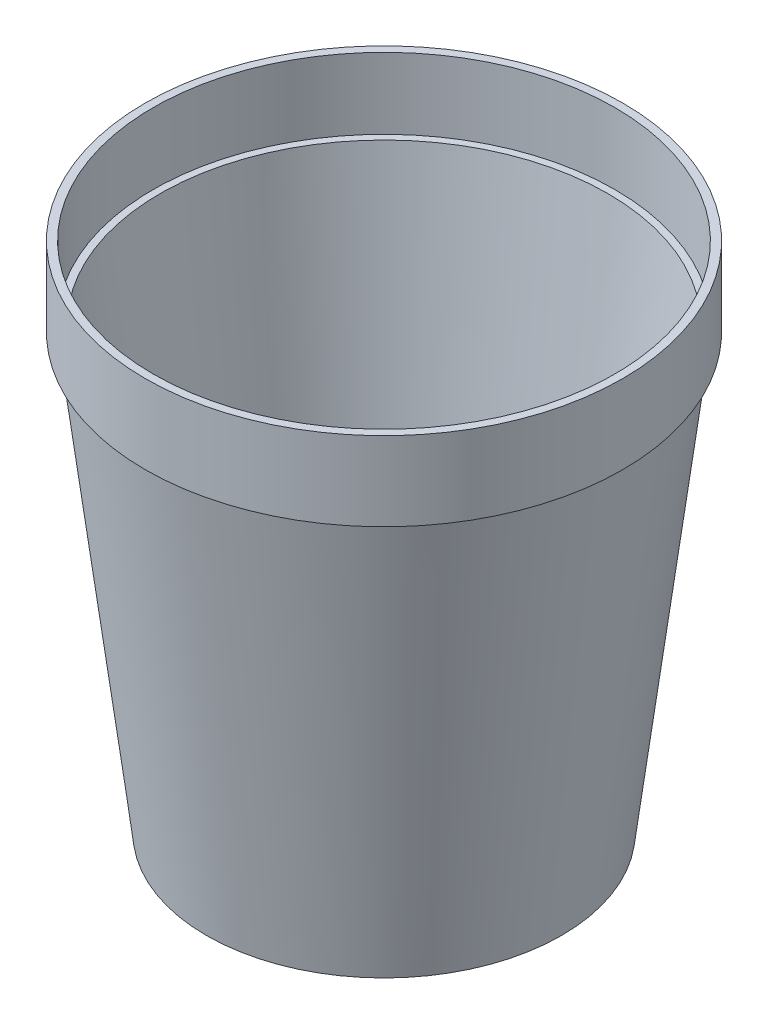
from build123d import *

# Parameters (mm, degrees)
SHELL1_T = -2


with BuildPart() as part:
    # Sketch3 → Revolve1 (revolve)
    with BuildSketch(Plane.XY, mode=Mode.PRIVATE) as revolve1_sk:
        Polygon((0, 0), (0, 130), (60.506301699, 130), (60.506301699, 110), (58.506301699, 110), (45, 0), align=None)
    revolve(revolve1_sk.sketch.rotate(Axis((0, 0, 0), (0, 1, 0)), 90), axis=Axis((0, 0, 0), (0, 1, 0)))

    # Shell1
    shell1_openings = [part.faces().sort_by_distance(p)[0] for p in [
        (0, 130, 0),
    ]]
    offset(amount=SHELL1_T, openings=shell1_openings, kind=Kind.INTERSECTION)


solid = part.part
